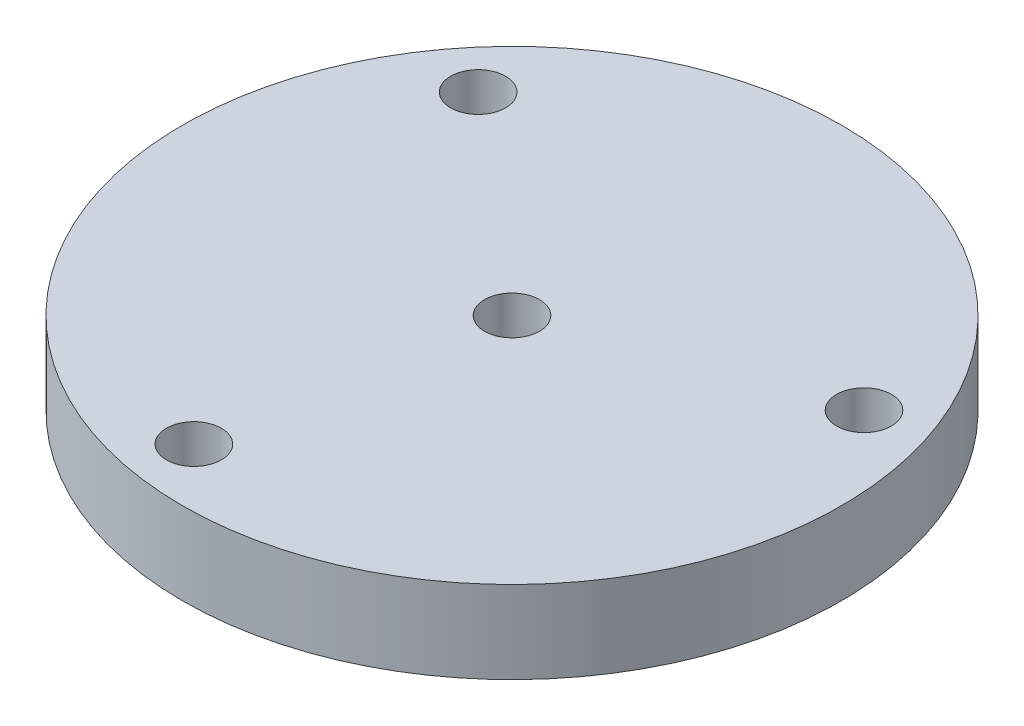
ISO-10303-21;
HEADER;
FILE_DESCRIPTION(('STEP AP214'),'2;1');
FILE_NAME('part.step','',(''),(''),'','','');
FILE_SCHEMA(('AUTOMOTIVE_DESIGN { 1 0 10303 214 1 1 1 1 }'));
ENDSEC;
DATA;
#1=APPLICATION_CONTEXT('core data for automotive mechanical design processes');
#2=APPLICATION_PROTOCOL_DEFINITION('international standard','automotive_design',2000,#1);
#3=PRODUCT_CONTEXT('',#1,'mechanical');
#4=PRODUCT('Part','Part','',(#3));
#5=PRODUCT_RELATED_PRODUCT_CATEGORY('part','',(#4));
#6=PRODUCT_DEFINITION_FORMATION('','',#4);
#7=PRODUCT_DEFINITION_CONTEXT('part definition',#1,'design');
#8=PRODUCT_DEFINITION('design','',#6,#7);
#9=PRODUCT_DEFINITION_SHAPE('','',#8);
#10=(LENGTH_UNIT() NAMED_UNIT(*) SI_UNIT(.MILLI.,.METRE.));
#11=(NAMED_UNIT(*) PLANE_ANGLE_UNIT() SI_UNIT($,.RADIAN.));
#12=(NAMED_UNIT(*) SI_UNIT($,.STERADIAN.) SOLID_ANGLE_UNIT());
#13=UNCERTAINTY_MEASURE_WITH_UNIT(LENGTH_MEASURE(1.E-05),#10,'distance_accuracy_value','');
#14=(GEOMETRIC_REPRESENTATION_CONTEXT(3) GLOBAL_UNCERTAINTY_ASSIGNED_CONTEXT((#13)) GLOBAL_UNIT_ASSIGNED_CONTEXT((#10,
#11,#12)) REPRESENTATION_CONTEXT('',''));
#15=CARTESIAN_POINT('',(0.,0.,0.));
#16=DIRECTION('',(0.,0.,1.));
#17=DIRECTION('',(1.,0.,0.));
#18=AXIS2_PLACEMENT_3D('',#15,#16,#17);
#19=CARTESIAN_POINT('',(0.,30.,0.));
#20=DIRECTION('',(0.,1.,0.));
#21=DIRECTION('',(0.,0.,1.));
#22=AXIS2_PLACEMENT_3D('',#19,#20,#21);
#23=PLANE('',#22);
#24=CARTESIAN_POINT('',(0.,30.,0.));
#25=DIRECTION('',(0.,1.,0.));
#26=DIRECTION('',(0.,0.,1.));
#27=AXIS2_PLACEMENT_3D('',#24,#25,#26);
#28=CIRCLE('',#27,10.);
#29=CARTESIAN_POINT('',(0.,30.,10.));
#30=VERTEX_POINT('',#29);
#31=EDGE_CURVE('E63',#30,#30,#28,.T.);
#32=ORIENTED_EDGE('',*,*,#31,.F.);
#33=EDGE_LOOP('',(#32));
#34=FACE_BOUND('',#33,.T.);
#35=CARTESIAN_POINT('',(-76.6044443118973,30.,-64.2787609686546));
#36=DIRECTION('',(0.,1.,0.));
#37=DIRECTION('',(0.866025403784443,0.,-0.499999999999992));
#38=AXIS2_PLACEMENT_3D('',#35,#36,#37);
#39=CIRCLE('',#38,10.);
#40=CARTESIAN_POINT('',(-67.9441902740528,30.,-69.2787609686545));
#41=VERTEX_POINT('',#40);
#42=EDGE_CURVE('E57',#41,#41,#39,.T.);
#43=ORIENTED_EDGE('',*,*,#42,.F.);
#44=EDGE_LOOP('',(#43));
#45=FACE_BOUND('',#44,.T.);
#46=CARTESIAN_POINT('',(-17.3648177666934,30.,98.4807753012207));
#47=DIRECTION('',(0.,1.,0.));
#48=DIRECTION('',(-0.866025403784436,0.,-0.500000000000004));
#49=AXIS2_PLACEMENT_3D('',#46,#47,#48);
#50=CIRCLE('',#49,10.);
#51=CARTESIAN_POINT('',(-26.0250718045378,30.,93.4807753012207));
#52=VERTEX_POINT('',#51);
#53=EDGE_CURVE('E51',#52,#52,#50,.T.);
#54=ORIENTED_EDGE('',*,*,#53,.F.);
#55=EDGE_LOOP('',(#54));
#56=FACE_BOUND('',#55,.T.);
#57=CARTESIAN_POINT('',(93.9692620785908,30.,-34.2020143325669));
#58=DIRECTION('',(0.,1.,0.));
#59=DIRECTION('',(0.,0.,1.));
#60=AXIS2_PLACEMENT_3D('',#57,#58,#59);
#61=CIRCLE('',#60,10.);
#62=CARTESIAN_POINT('',(93.9692620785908,30.,-24.2020143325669));
#63=VERTEX_POINT('',#62);
#64=EDGE_CURVE('E45',#63,#63,#61,.T.);
#65=ORIENTED_EDGE('',*,*,#64,.F.);
#66=EDGE_LOOP('',(#65));
#67=FACE_BOUND('',#66,.T.);
#68=CARTESIAN_POINT('',(0.,30.,0.));
#69=DIRECTION('',(0.,-1.,0.));
#70=DIRECTION('',(0.,0.,-1.));
#71=AXIS2_PLACEMENT_3D('',#68,#69,#70);
#72=CIRCLE('',#71,120.);
#73=CARTESIAN_POINT('',(0.,30.,-120.));
#74=VERTEX_POINT('',#73);
#75=EDGE_CURVE('E10',#74,#74,#72,.T.);
#76=ORIENTED_EDGE('',*,*,#75,.F.);
#77=EDGE_LOOP('',(#76));
#78=FACE_BOUND('',#77,.T.);
#79=ADVANCED_FACE('F31',(#34,#45,#56,#67,#78),#23,.T.);
#80=CARTESIAN_POINT('',(0.,-34.9782122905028,0.));
#81=DIRECTION('',(0.,-1.,0.));
#82=DIRECTION('',(0.,0.,-1.));
#83=AXIS2_PLACEMENT_3D('',#80,#81,#82);
#84=CYLINDRICAL_SURFACE('',#83,120.);
#85=ORIENTED_EDGE('',*,*,#75,.T.);
#86=EDGE_LOOP('',(#85));
#87=FACE_BOUND('',#86,.T.);
#88=CARTESIAN_POINT('',(0.,0.,0.));
#89=DIRECTION('',(0.,-1.,0.));
#90=DIRECTION('',(0.,0.,-1.));
#91=AXIS2_PLACEMENT_3D('',#88,#89,#90);
#92=CIRCLE('',#91,120.);
#93=CARTESIAN_POINT('',(0.,0.,-120.));
#94=VERTEX_POINT('',#93);
#95=EDGE_CURVE('E37',#94,#94,#92,.T.);
#96=ORIENTED_EDGE('',*,*,#95,.F.);
#97=EDGE_LOOP('',(#96));
#98=FACE_BOUND('',#97,.T.);
#99=ADVANCED_FACE('F81',(#87,#98),#84,.T.);
#100=CARTESIAN_POINT('',(0.,0.,0.));
#101=DIRECTION('',(0.,-1.,0.));
#102=DIRECTION('',(0.,0.,-1.));
#103=AXIS2_PLACEMENT_3D('',#100,#101,#102);
#104=PLANE('',#103);
#105=CARTESIAN_POINT('',(0.,0.,0.));
#106=DIRECTION('',(0.,1.,0.));
#107=DIRECTION('',(0.,0.,1.));
#108=AXIS2_PLACEMENT_3D('',#105,#106,#107);
#109=CIRCLE('',#108,10.);
#110=CARTESIAN_POINT('',(0.,0.,10.));
#111=VERTEX_POINT('',#110);
#112=EDGE_CURVE('E60',#111,#111,#109,.T.);
#113=ORIENTED_EDGE('',*,*,#112,.T.);
#114=EDGE_LOOP('',(#113));
#115=FACE_BOUND('',#114,.T.);
#116=CARTESIAN_POINT('',(-76.6044443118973,0.,-64.2787609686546));
#117=DIRECTION('',(0.,1.,0.));
#118=DIRECTION('',(0.866025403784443,0.,-0.499999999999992));
#119=AXIS2_PLACEMENT_3D('',#116,#117,#118);
#120=CIRCLE('',#119,10.);
#121=CARTESIAN_POINT('',(-67.9441902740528,0.,-69.2787609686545));
#122=VERTEX_POINT('',#121);
#123=EDGE_CURVE('E54',#122,#122,#120,.T.);
#124=ORIENTED_EDGE('',*,*,#123,.T.);
#125=EDGE_LOOP('',(#124));
#126=FACE_BOUND('',#125,.T.);
#127=CARTESIAN_POINT('',(-17.3648177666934,0.,98.4807753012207));
#128=DIRECTION('',(0.,1.,0.));
#129=DIRECTION('',(-0.866025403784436,0.,-0.500000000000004));
#130=AXIS2_PLACEMENT_3D('',#127,#128,#129);
#131=CIRCLE('',#130,10.);
#132=CARTESIAN_POINT('',(-26.0250718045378,0.,93.4807753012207));
#133=VERTEX_POINT('',#132);
#134=EDGE_CURVE('E49',#133,#133,#131,.T.);
#135=ORIENTED_EDGE('',*,*,#134,.T.);
#136=EDGE_LOOP('',(#135));
#137=FACE_BOUND('',#136,.T.);
#138=CARTESIAN_POINT('',(93.9692620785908,0.,-34.2020143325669));
#139=DIRECTION('',(0.,1.,0.));
#140=DIRECTION('',(0.,0.,1.));
#141=AXIS2_PLACEMENT_3D('',#138,#139,#140);
#142=CIRCLE('',#141,10.);
#143=CARTESIAN_POINT('',(93.9692620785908,0.,-24.2020143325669));
#144=VERTEX_POINT('',#143);
#145=EDGE_CURVE('E41',#144,#144,#142,.T.);
#146=ORIENTED_EDGE('',*,*,#145,.T.);
#147=EDGE_LOOP('',(#146));
#148=FACE_BOUND('',#147,.T.);
#149=ORIENTED_EDGE('',*,*,#95,.T.);
#150=EDGE_LOOP('',(#149));
#151=FACE_BOUND('',#150,.T.);
#152=ADVANCED_FACE('F69',(#115,#126,#137,#148,#151),#104,.T.);
#153=CARTESIAN_POINT('',(93.9692620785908,0.,-34.2020143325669));
#154=DIRECTION('',(0.,1.,0.));
#155=DIRECTION('',(0.,0.,1.));
#156=AXIS2_PLACEMENT_3D('',#153,#154,#155);
#157=CYLINDRICAL_SURFACE('',#156,10.);
#158=ORIENTED_EDGE('',*,*,#145,.F.);
#159=EDGE_LOOP('',(#158));
#160=FACE_BOUND('',#159,.T.);
#161=ORIENTED_EDGE('',*,*,#64,.T.);
#162=EDGE_LOOP('',(#161));
#163=FACE_BOUND('',#162,.T.);
#164=ADVANCED_FACE('F89',(#160,#163),#157,.F.);
#165=CARTESIAN_POINT('',(-17.3648177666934,0.,98.4807753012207));
#166=DIRECTION('',(0.,1.,0.));
#167=DIRECTION('',(0.,0.,1.));
#168=AXIS2_PLACEMENT_3D('',#165,#166,#167);
#169=CYLINDRICAL_SURFACE('',#168,10.);
#170=ORIENTED_EDGE('',*,*,#134,.F.);
#171=EDGE_LOOP('',(#170));
#172=FACE_BOUND('',#171,.T.);
#173=ORIENTED_EDGE('',*,*,#53,.T.);
#174=EDGE_LOOP('',(#173));
#175=FACE_BOUND('',#174,.T.);
#176=ADVANCED_FACE('F91',(#172,#175),#169,.F.);
#177=CARTESIAN_POINT('',(-76.6044443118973,0.,-64.2787609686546));
#178=DIRECTION('',(0.,1.,0.));
#179=DIRECTION('',(0.,0.,1.));
#180=AXIS2_PLACEMENT_3D('',#177,#178,#179);
#181=CYLINDRICAL_SURFACE('',#180,10.);
#182=ORIENTED_EDGE('',*,*,#123,.F.);
#183=EDGE_LOOP('',(#182));
#184=FACE_BOUND('',#183,.T.);
#185=ORIENTED_EDGE('',*,*,#42,.T.);
#186=EDGE_LOOP('',(#185));
#187=FACE_BOUND('',#186,.T.);
#188=ADVANCED_FACE('F75',(#184,#187),#181,.F.);
#189=CARTESIAN_POINT('',(0.,0.,0.));
#190=DIRECTION('',(0.,1.,0.));
#191=DIRECTION('',(0.,0.,1.));
#192=AXIS2_PLACEMENT_3D('',#189,#190,#191);
#193=CYLINDRICAL_SURFACE('',#192,10.);
#194=ORIENTED_EDGE('',*,*,#112,.F.);
#195=EDGE_LOOP('',(#194));
#196=FACE_BOUND('',#195,.T.);
#197=ORIENTED_EDGE('',*,*,#31,.T.);
#198=EDGE_LOOP('',(#197));
#199=FACE_BOUND('',#198,.T.);
#200=ADVANCED_FACE('F72',(#196,#199),#193,.F.);
#201=CLOSED_SHELL('',(#79,#99,#152,#164,#176,#188,#200));
#202=MANIFOLD_SOLID_BREP('B2',#201);
#203=ADVANCED_BREP_SHAPE_REPRESENTATION('',(#18,#202),#14);
#204=SHAPE_DEFINITION_REPRESENTATION(#9,#203);
ENDSEC;
END-ISO-10303-21;
